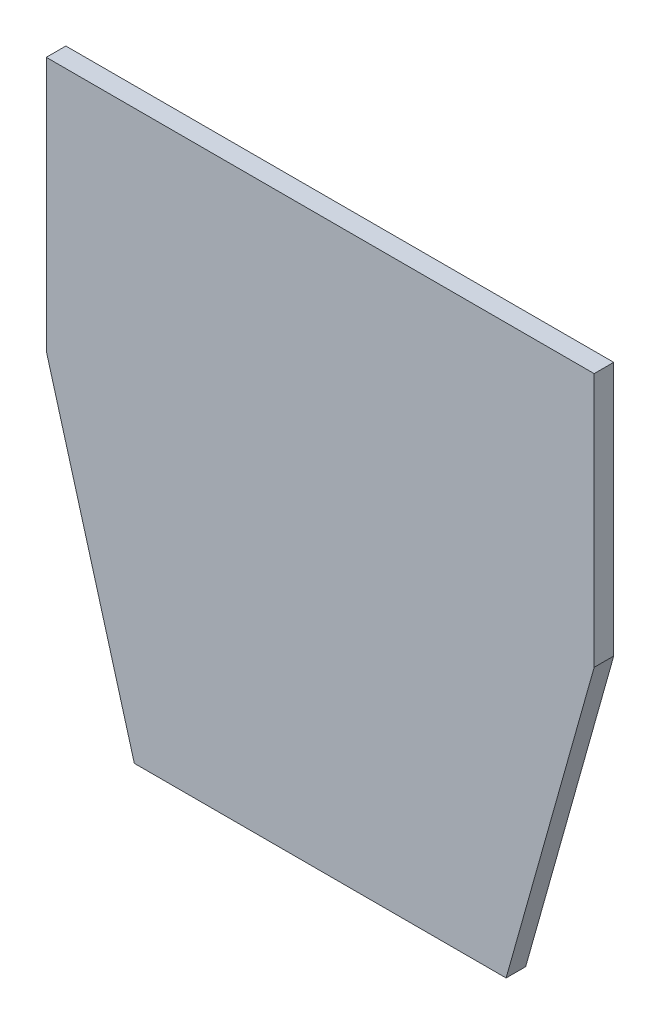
from build123d import *

# Parameters (mm, degrees)
BOSS_EXTRU_1_DEPTH = 10


with BuildPart() as part:
    # Esquisse1 → Boss.-Extru.1 (new body)
    with BuildSketch(Plane.XY):
        Polygon((-95, 0), (95, 0), (140, 160), (140, 290), (-140, 290), (-140, 160), align=None)
    extrude(amount=BOSS_EXTRU_1_DEPTH)


solid = part.part
